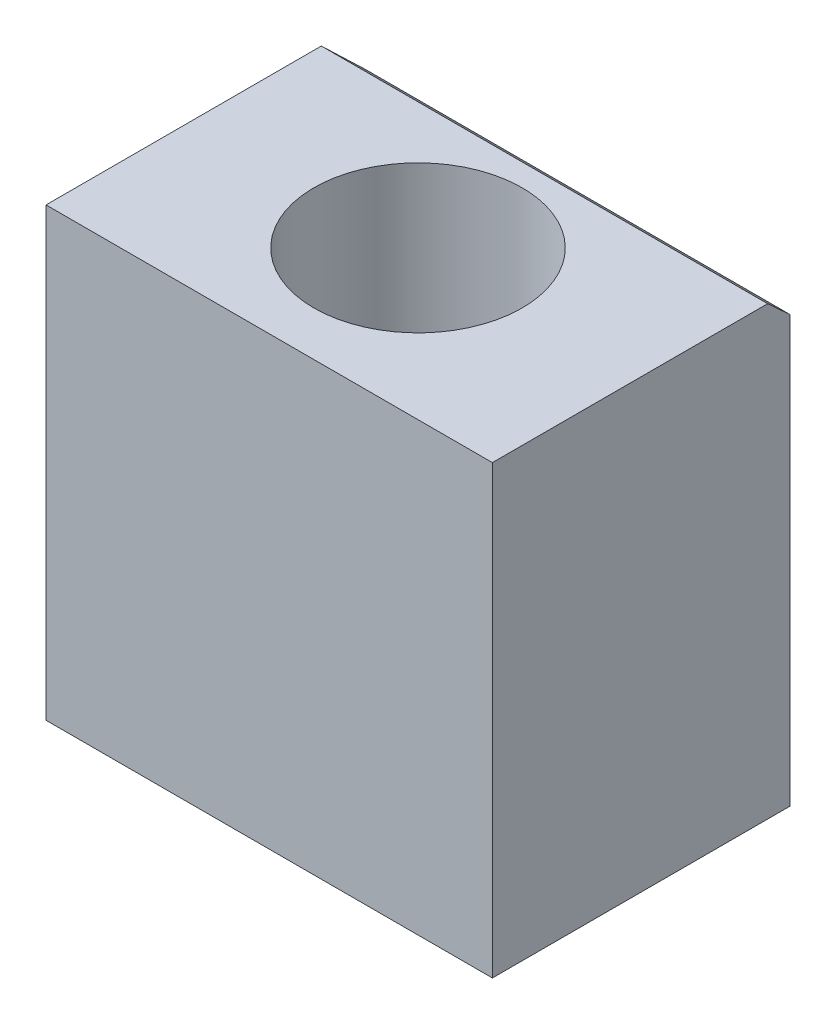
ISO-10303-21;
HEADER;
FILE_DESCRIPTION(('STEP AP214'),'2;1');
FILE_NAME('part.step','',(''),(''),'','','');
FILE_SCHEMA(('AUTOMOTIVE_DESIGN { 1 0 10303 214 1 1 1 1 }'));
ENDSEC;
DATA;
#1=APPLICATION_CONTEXT('core data for automotive mechanical design processes');
#2=APPLICATION_PROTOCOL_DEFINITION('international standard','automotive_design',2000,#1);
#3=PRODUCT_CONTEXT('',#1,'mechanical');
#4=PRODUCT('Part','Part','',(#3));
#5=PRODUCT_RELATED_PRODUCT_CATEGORY('part','',(#4));
#6=PRODUCT_DEFINITION_FORMATION('','',#4);
#7=PRODUCT_DEFINITION_CONTEXT('part definition',#1,'design');
#8=PRODUCT_DEFINITION('design','',#6,#7);
#9=PRODUCT_DEFINITION_SHAPE('','',#8);
#10=(LENGTH_UNIT() NAMED_UNIT(*) SI_UNIT(.MILLI.,.METRE.));
#11=(NAMED_UNIT(*) PLANE_ANGLE_UNIT() SI_UNIT($,.RADIAN.));
#12=(NAMED_UNIT(*) SI_UNIT($,.STERADIAN.) SOLID_ANGLE_UNIT());
#13=UNCERTAINTY_MEASURE_WITH_UNIT(LENGTH_MEASURE(1.E-05),#10,'distance_accuracy_value','');
#14=(GEOMETRIC_REPRESENTATION_CONTEXT(3) GLOBAL_UNCERTAINTY_ASSIGNED_CONTEXT((#13)) GLOBAL_UNIT_ASSIGNED_CONTEXT((#10,
#11,#12)) REPRESENTATION_CONTEXT('',''));
#15=CARTESIAN_POINT('',(0.,0.,0.));
#16=DIRECTION('',(0.,0.,1.));
#17=DIRECTION('',(1.,0.,0.));
#18=AXIS2_PLACEMENT_3D('',#15,#16,#17);
#19=CARTESIAN_POINT('',(0.,0.,20.));
#20=DIRECTION('',(1.,0.,0.));
#21=DIRECTION('',(0.,1.,0.));
#22=AXIS2_PLACEMENT_3D('',#19,#20,#21);
#23=PLANE('',#22);
#24=DIRECTION('',(0.,0.,-1.));
#25=VECTOR('',#24,1.);
#26=CARTESIAN_POINT('',(0.,0.,20.));
#27=LINE('',#26,#25);
#28=CARTESIAN_POINT('',(0.,0.,20.));
#29=VERTEX_POINT('',#28);
#30=CARTESIAN_POINT('',(0.,0.,1.5));
#31=VERTEX_POINT('',#30);
#32=EDGE_CURVE('E107',#29,#31,#27,.T.);
#33=ORIENTED_EDGE('',*,*,#32,.T.);
#34=DIRECTION('',(0.,1.,0.));
#35=VECTOR('',#34,1.);
#36=CARTESIAN_POINT('',(0.,-30.,1.5));
#37=LINE('',#36,#35);
#38=CARTESIAN_POINT('',(0.,-30.,1.5));
#39=VERTEX_POINT('',#38);
#40=EDGE_CURVE('E80',#39,#31,#37,.T.);
#41=ORIENTED_EDGE('',*,*,#40,.F.);
#42=DIRECTION('',(0.,0.,-1.));
#43=VECTOR('',#42,1.);
#44=CARTESIAN_POINT('',(0.,-30.,20.));
#45=LINE('',#44,#43);
#46=CARTESIAN_POINT('',(0.,-30.,20.));
#47=VERTEX_POINT('',#46);
#48=EDGE_CURVE('E40',#47,#39,#45,.T.);
#49=ORIENTED_EDGE('',*,*,#48,.F.);
#50=DIRECTION('',(0.,-1.,0.));
#51=VECTOR('',#50,1.);
#52=CARTESIAN_POINT('',(0.,0.,20.));
#53=LINE('',#52,#51);
#54=EDGE_CURVE('E93',#29,#47,#53,.T.);
#55=ORIENTED_EDGE('',*,*,#54,.F.);
#56=EDGE_LOOP('',(#33,#41,#49,#55));
#57=FACE_BOUND('',#56,.T.);
#58=ADVANCED_FACE('F33',(#57),#23,.F.);
#59=CARTESIAN_POINT('',(0.,-30.,20.));
#60=DIRECTION('',(0.,1.,0.));
#61=DIRECTION('',(0.,0.,1.));
#62=AXIS2_PLACEMENT_3D('',#59,#60,#61);
#63=PLANE('',#62);
#64=CARTESIAN_POINT('',(15.,-30.,10.));
#65=DIRECTION('',(0.,1.,0.));
#66=DIRECTION('',(0.,0.,1.));
#67=AXIS2_PLACEMENT_3D('',#64,#65,#66);
#68=CIRCLE('',#67,7.);
#69=CARTESIAN_POINT('',(15.,-30.,17.));
#70=VERTEX_POINT('',#69);
#71=EDGE_CURVE('E113',#70,#70,#68,.T.);
#72=ORIENTED_EDGE('',*,*,#71,.T.);
#73=EDGE_LOOP('',(#72));
#74=FACE_BOUND('',#73,.T.);
#75=ORIENTED_EDGE('',*,*,#48,.T.);
#76=DIRECTION('',(0.707106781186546,0.,-0.707106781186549));
#77=VECTOR('',#76,1.);
#78=CARTESIAN_POINT('',(0.,-30.,1.5));
#79=LINE('',#78,#77);
#80=CARTESIAN_POINT('',(1.49999999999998,-30.,0.));
#81=VERTEX_POINT('',#80);
#82=EDGE_CURVE('E119',#39,#81,#79,.T.);
#83=ORIENTED_EDGE('',*,*,#82,.T.);
#84=DIRECTION('',(1.,0.,0.));
#85=VECTOR('',#84,1.);
#86=CARTESIAN_POINT('',(0.,-30.,0.));
#87=LINE('',#86,#85);
#88=CARTESIAN_POINT('',(30.,-30.,0.));
#89=VERTEX_POINT('',#88);
#90=EDGE_CURVE('E69',#81,#89,#87,.T.);
#91=ORIENTED_EDGE('',*,*,#90,.T.);
#92=DIRECTION('',(0.,0.,-1.));
#93=VECTOR('',#92,1.);
#94=CARTESIAN_POINT('',(30.,-30.,20.));
#95=LINE('',#94,#93);
#96=CARTESIAN_POINT('',(30.,-30.,20.));
#97=VERTEX_POINT('',#96);
#98=EDGE_CURVE('E97',#97,#89,#95,.T.);
#99=ORIENTED_EDGE('',*,*,#98,.F.);
#100=DIRECTION('',(1.,0.,0.));
#101=VECTOR('',#100,1.);
#102=CARTESIAN_POINT('',(0.,-30.,20.));
#103=LINE('',#102,#101);
#104=EDGE_CURVE('E87',#47,#97,#103,.T.);
#105=ORIENTED_EDGE('',*,*,#104,.F.);
#106=EDGE_LOOP('',(#75,#83,#91,#99,#105));
#107=FACE_BOUND('',#106,.T.);
#108=ADVANCED_FACE('F98',(#74,#107),#63,.F.);
#109=CARTESIAN_POINT('',(30.,0.,20.));
#110=DIRECTION('',(-1.,0.,0.));
#111=DIRECTION('',(0.,-1.,0.));
#112=AXIS2_PLACEMENT_3D('',#109,#110,#111);
#113=PLANE('',#112);
#114=DIRECTION('',(0.,1.,0.));
#115=VECTOR('',#114,1.);
#116=CARTESIAN_POINT('',(30.,0.,0.));
#117=LINE('',#116,#115);
#118=CARTESIAN_POINT('',(30.,-1.3774343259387,0.));
#119=VERTEX_POINT('',#118);
#120=EDGE_CURVE('E112',#89,#119,#117,.T.);
#121=ORIENTED_EDGE('',*,*,#120,.T.);
#122=DIRECTION('',(0.,-0.67637391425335,-0.736558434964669));
#123=VECTOR('',#122,1.);
#124=CARTESIAN_POINT('',(30.,0.,1.5));
#125=LINE('',#124,#123);
#126=CARTESIAN_POINT('',(30.,0.,1.5));
#127=VERTEX_POINT('',#126);
#128=EDGE_CURVE('E124',#127,#119,#125,.T.);
#129=ORIENTED_EDGE('',*,*,#128,.F.);
#130=DIRECTION('',(0.,0.,-1.));
#131=VECTOR('',#130,1.);
#132=CARTESIAN_POINT('',(30.,0.,20.));
#133=LINE('',#132,#131);
#134=CARTESIAN_POINT('',(30.,0.,20.));
#135=VERTEX_POINT('',#134);
#136=EDGE_CURVE('E101',#135,#127,#133,.T.);
#137=ORIENTED_EDGE('',*,*,#136,.F.);
#138=DIRECTION('',(0.,1.,0.));
#139=VECTOR('',#138,1.);
#140=CARTESIAN_POINT('',(30.,0.,20.));
#141=LINE('',#140,#139);
#142=EDGE_CURVE('E90',#97,#135,#141,.T.);
#143=ORIENTED_EDGE('',*,*,#142,.F.);
#144=ORIENTED_EDGE('',*,*,#98,.T.);
#145=EDGE_LOOP('',(#121,#129,#137,#143,#144));
#146=FACE_BOUND('',#145,.T.);
#147=ADVANCED_FACE('F103',(#146),#113,.F.);
#148=CARTESIAN_POINT('',(0.,0.,20.));
#149=DIRECTION('',(0.,-1.,0.));
#150=DIRECTION('',(0.,0.,-1.));
#151=AXIS2_PLACEMENT_3D('',#148,#149,#150);
#152=PLANE('',#151);
#153=CARTESIAN_POINT('',(15.,0.,10.));
#154=DIRECTION('',(0.,1.,0.));
#155=DIRECTION('',(0.,0.,1.));
#156=AXIS2_PLACEMENT_3D('',#153,#154,#155);
#157=CIRCLE('',#156,7.);
#158=CARTESIAN_POINT('',(15.,0.,17.));
#159=VERTEX_POINT('',#158);
#160=EDGE_CURVE('E131',#159,#159,#157,.T.);
#161=ORIENTED_EDGE('',*,*,#160,.F.);
#162=EDGE_LOOP('',(#161));
#163=FACE_BOUND('',#162,.T.);
#164=ORIENTED_EDGE('',*,*,#136,.T.);
#165=DIRECTION('',(1.,0.,0.));
#166=VECTOR('',#165,1.);
#167=CARTESIAN_POINT('',(0.,0.,1.5));
#168=LINE('',#167,#166);
#169=EDGE_CURVE('E129',#31,#127,#168,.T.);
#170=ORIENTED_EDGE('',*,*,#169,.F.);
#171=ORIENTED_EDGE('',*,*,#32,.F.);
#172=DIRECTION('',(-1.,0.,0.));
#173=VECTOR('',#172,1.);
#174=CARTESIAN_POINT('',(0.,0.,20.));
#175=LINE('',#174,#173);
#176=EDGE_CURVE('E56',#135,#29,#175,.T.);
#177=ORIENTED_EDGE('',*,*,#176,.F.);
#178=EDGE_LOOP('',(#164,#170,#171,#177));
#179=FACE_BOUND('',#178,.T.);
#180=ADVANCED_FACE('F161',(#163,#179),#152,.F.);
#181=CARTESIAN_POINT('',(0.,-30.,20.));
#182=DIRECTION('',(0.,0.,1.));
#183=DIRECTION('',(1.,0.,0.));
#184=AXIS2_PLACEMENT_3D('',#181,#182,#183);
#185=PLANE('',#184);
#186=ORIENTED_EDGE('',*,*,#54,.T.);
#187=ORIENTED_EDGE('',*,*,#104,.T.);
#188=ORIENTED_EDGE('',*,*,#142,.T.);
#189=ORIENTED_EDGE('',*,*,#176,.T.);
#190=EDGE_LOOP('',(#186,#187,#188,#189));
#191=FACE_BOUND('',#190,.T.);
#192=ADVANCED_FACE('F88',(#191),#185,.T.);
#193=CARTESIAN_POINT('',(0.,-30.,0.));
#194=DIRECTION('',(0.,0.,1.));
#195=DIRECTION('',(1.,0.,0.));
#196=AXIS2_PLACEMENT_3D('',#193,#194,#195);
#197=PLANE('',#196);
#198=ORIENTED_EDGE('',*,*,#90,.F.);
#199=DIRECTION('',(0.,1.,0.));
#200=VECTOR('',#199,1.);
#201=CARTESIAN_POINT('',(1.49999999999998,-30.,0.));
#202=LINE('',#201,#200);
#203=CARTESIAN_POINT('',(1.49999999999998,-1.37743432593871,0.));
#204=VERTEX_POINT('',#203);
#205=EDGE_CURVE('E122',#81,#204,#202,.T.);
#206=ORIENTED_EDGE('',*,*,#205,.T.);
#207=DIRECTION('',(1.,0.,0.));
#208=VECTOR('',#207,1.);
#209=CARTESIAN_POINT('',(0.,-1.37743432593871,0.));
#210=LINE('',#209,#208);
#211=EDGE_CURVE('E47',#204,#119,#210,.T.);
#212=ORIENTED_EDGE('',*,*,#211,.T.);
#213=ORIENTED_EDGE('',*,*,#120,.F.);
#214=EDGE_LOOP('',(#198,#206,#212,#213));
#215=FACE_BOUND('',#214,.T.);
#216=ADVANCED_FACE('F142',(#215),#197,.F.);
#217=CARTESIAN_POINT('',(15.,0.,10.));
#218=DIRECTION('',(0.,1.,0.));
#219=DIRECTION('',(0.,0.,1.));
#220=AXIS2_PLACEMENT_3D('',#217,#218,#219);
#221=CYLINDRICAL_SURFACE('',#220,7.);
#222=ORIENTED_EDGE('',*,*,#160,.T.);
#223=EDGE_LOOP('',(#222));
#224=FACE_BOUND('',#223,.T.);
#225=ORIENTED_EDGE('',*,*,#71,.F.);
#226=EDGE_LOOP('',(#225));
#227=FACE_BOUND('',#226,.T.);
#228=ADVANCED_FACE('F139',(#224,#227),#221,.F.);
#229=CARTESIAN_POINT('',(0.,0.,1.5));
#230=DIRECTION('',(0.,-0.736558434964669,0.67637391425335));
#231=DIRECTION('',(0.,-0.67637391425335,-0.736558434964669));
#232=AXIS2_PLACEMENT_3D('',#229,#230,#231);
#233=PLANE('',#232);
#234=ORIENTED_EDGE('',*,*,#211,.F.);
#235=DIRECTION('',(-0.593050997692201,0.544592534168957,0.593050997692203));
#236=VECTOR('',#235,1.);
#237=CARTESIAN_POINT('',(0.,0.,1.5));
#238=LINE('',#237,#236);
#239=EDGE_CURVE('E11',#204,#31,#238,.T.);
#240=ORIENTED_EDGE('',*,*,#239,.T.);
#241=ORIENTED_EDGE('',*,*,#169,.T.);
#242=ORIENTED_EDGE('',*,*,#128,.T.);
#243=EDGE_LOOP('',(#234,#240,#241,#242));
#244=FACE_BOUND('',#243,.T.);
#245=ADVANCED_FACE('F141',(#244),#233,.F.);
#246=CARTESIAN_POINT('',(0.,-30.,1.5));
#247=DIRECTION('',(0.707106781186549,0.,0.707106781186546));
#248=DIRECTION('',(0.707106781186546,0.,-0.707106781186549));
#249=AXIS2_PLACEMENT_3D('',#246,#247,#248);
#250=PLANE('',#249);
#251=ORIENTED_EDGE('',*,*,#205,.F.);
#252=ORIENTED_EDGE('',*,*,#82,.F.);
#253=ORIENTED_EDGE('',*,*,#40,.T.);
#254=ORIENTED_EDGE('',*,*,#239,.F.);
#255=EDGE_LOOP('',(#251,#252,#253,#254));
#256=FACE_BOUND('',#255,.T.);
#257=ADVANCED_FACE('F149',(#256),#250,.F.);
#258=CLOSED_SHELL('',(#58,#108,#147,#180,#192,#216,#228,#245,#257));
#259=MANIFOLD_SOLID_BREP('B2',#258);
#260=ADVANCED_BREP_SHAPE_REPRESENTATION('',(#18,#259),#14);
#261=SHAPE_DEFINITION_REPRESENTATION(#9,#260);
ENDSEC;
END-ISO-10303-21;
